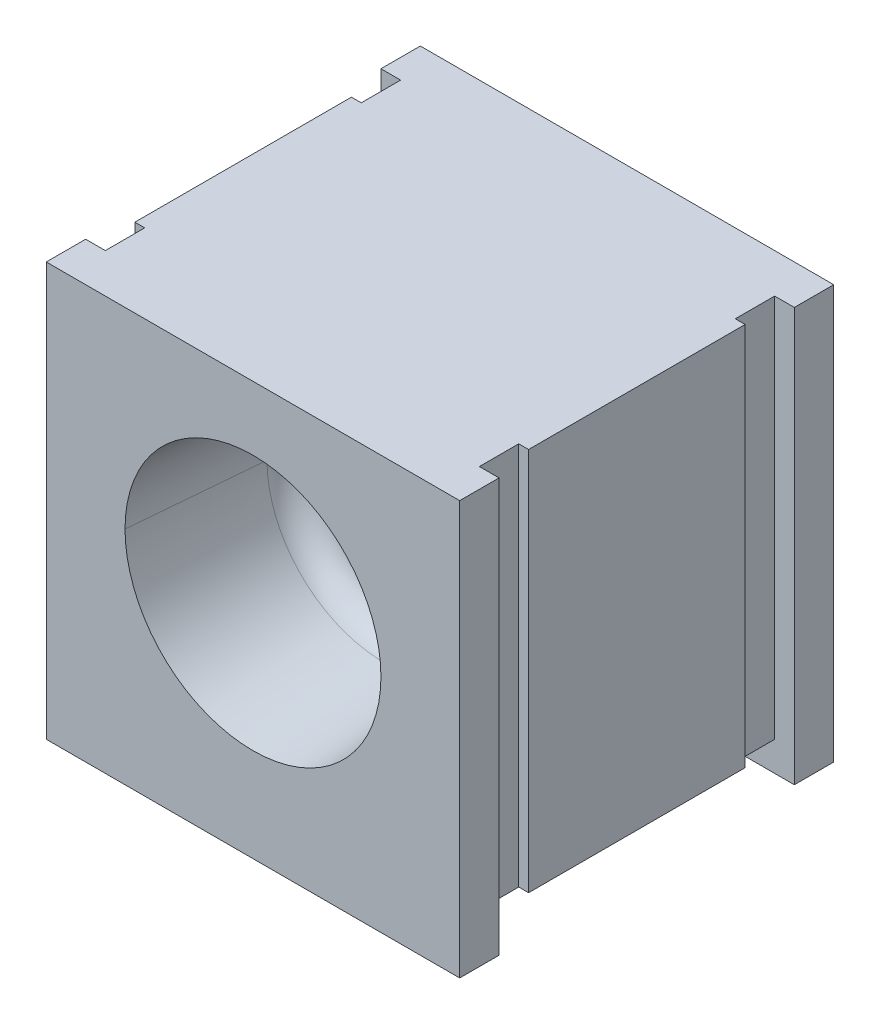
ISO-10303-21;
HEADER;
FILE_DESCRIPTION(('STEP AP214'),'2;1');
FILE_NAME('part.step','',(''),(''),'','','');
FILE_SCHEMA(('AUTOMOTIVE_DESIGN { 1 0 10303 214 1 1 1 1 }'));
ENDSEC;
DATA;
#1=APPLICATION_CONTEXT('core data for automotive mechanical design processes');
#2=APPLICATION_PROTOCOL_DEFINITION('international standard','automotive_design',2000,#1);
#3=PRODUCT_CONTEXT('',#1,'mechanical');
#4=PRODUCT('Part','Part','',(#3));
#5=PRODUCT_RELATED_PRODUCT_CATEGORY('part','',(#4));
#6=PRODUCT_DEFINITION_FORMATION('','',#4);
#7=PRODUCT_DEFINITION_CONTEXT('part definition',#1,'design');
#8=PRODUCT_DEFINITION('design','',#6,#7);
#9=PRODUCT_DEFINITION_SHAPE('','',#8);
#10=(LENGTH_UNIT() NAMED_UNIT(*) SI_UNIT(.MILLI.,.METRE.));
#11=(NAMED_UNIT(*) PLANE_ANGLE_UNIT() SI_UNIT($,.RADIAN.));
#12=(NAMED_UNIT(*) SI_UNIT($,.STERADIAN.) SOLID_ANGLE_UNIT());
#13=UNCERTAINTY_MEASURE_WITH_UNIT(LENGTH_MEASURE(1.E-05),#10,'distance_accuracy_value','');
#14=(GEOMETRIC_REPRESENTATION_CONTEXT(3) GLOBAL_UNCERTAINTY_ASSIGNED_CONTEXT((#13)) GLOBAL_UNIT_ASSIGNED_CONTEXT((#10,
#11,#12)) REPRESENTATION_CONTEXT('',''));
#15=CARTESIAN_POINT('',(0.,0.,0.));
#16=DIRECTION('',(0.,0.,1.));
#17=DIRECTION('',(1.,0.,0.));
#18=AXIS2_PLACEMENT_3D('',#15,#16,#17);
#19=CARTESIAN_POINT('',(0.,0.75,12.5));
#20=DIRECTION('',(0.,0.,1.));
#21=DIRECTION('',(1.,0.,0.));
#22=AXIS2_PLACEMENT_3D('',#19,#20,#21);
#23=TOROIDAL_SURFACE('',#22,4.42559393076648,1.5);
#24=CARTESIAN_POINT('',(-4.42559393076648,0.75,12.5));
#25=DIRECTION('',(0.,1.,0.));
#26=DIRECTION('',(-1.,0.,0.));
#27=AXIS2_PLACEMENT_3D('',#24,#25,#26);
#28=CIRCLE('',#27,1.5);
#29=CARTESIAN_POINT('',(-4.42559393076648,0.75,11.));
#30=VERTEX_POINT('',#29);
#31=CARTESIAN_POINT('',(-5.91988597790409,0.75,12.3692663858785));
#32=VERTEX_POINT('',#31);
#33=EDGE_CURVE('E354',#30,#32,#28,.T.);
#34=ORIENTED_EDGE('',*,*,#33,.F.);
#35=CARTESIAN_POINT('',(0.,0.75,11.));
#36=DIRECTION('',(0.,0.,1.));
#37=DIRECTION('',(1.,0.,0.));
#38=AXIS2_PLACEMENT_3D('',#35,#36,#37);
#39=CIRCLE('',#38,4.42559393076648);
#40=CARTESIAN_POINT('',(4.42559393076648,0.75,11.));
#41=VERTEX_POINT('',#40);
#42=EDGE_CURVE('E9',#41,#30,#39,.T.);
#43=ORIENTED_EDGE('',*,*,#42,.F.);
#44=CARTESIAN_POINT('',(4.42559393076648,0.75,12.5));
#45=DIRECTION('',(0.,-1.,0.));
#46=DIRECTION('',(0.,0.,-1.));
#47=AXIS2_PLACEMENT_3D('',#44,#45,#46);
#48=CIRCLE('',#47,1.5);
#49=CARTESIAN_POINT('',(5.91988597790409,0.75,12.3692663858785));
#50=VERTEX_POINT('',#49);
#51=EDGE_CURVE('E347',#41,#50,#48,.T.);
#52=ORIENTED_EDGE('',*,*,#51,.T.);
#53=CARTESIAN_POINT('',(0.,0.75,12.3692663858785));
#54=DIRECTION('',(0.,0.,-1.));
#55=DIRECTION('',(-1.,0.,0.));
#56=AXIS2_PLACEMENT_3D('',#53,#54,#55);
#57=CIRCLE('',#56,5.91988597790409);
#58=EDGE_CURVE('E23',#32,#50,#57,.T.);
#59=ORIENTED_EDGE('',*,*,#58,.F.);
#60=EDGE_LOOP('',(#34,#43,#52,#59));
#61=FACE_BOUND('',#60,.T.);
#62=ADVANCED_FACE('F15',(#61),#23,.F.);
#63=CARTESIAN_POINT('',(0.,0.75,11.));
#64=DIRECTION('',(0.,0.,1.));
#65=DIRECTION('',(1.,0.,0.));
#66=AXIS2_PLACEMENT_3D('',#63,#64,#65);
#67=PLANE('',#66);
#68=ORIENTED_EDGE('',*,*,#42,.T.);
#69=CARTESIAN_POINT('',(0.,0.75,11.));
#70=DIRECTION('',(0.,0.,1.));
#71=DIRECTION('',(1.,0.,0.));
#72=AXIS2_PLACEMENT_3D('',#69,#70,#71);
#73=CIRCLE('',#72,4.42559393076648);
#74=EDGE_CURVE('E361',#30,#41,#73,.T.);
#75=ORIENTED_EDGE('',*,*,#74,.T.);
#76=EDGE_LOOP('',(#68,#75));
#77=FACE_BOUND('',#76,.T.);
#78=ADVANCED_FACE('F556',(#77),#67,.T.);
#79=CARTESIAN_POINT('',(0.,0.75,19.));
#80=DIRECTION('',(0.,0.,1.));
#81=DIRECTION('',(1.,0.,0.));
#82=AXIS2_PLACEMENT_3D('',#79,#80,#81);
#83=CONICAL_SURFACE('',#82,6.5,0.0872664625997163);
#84=DIRECTION('',(-0.0871557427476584,0.,0.996194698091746));
#85=VECTOR('',#84,1.);
#86=CARTESIAN_POINT('',(-6.5,0.75,19.));
#87=LINE('',#86,#85);
#88=CARTESIAN_POINT('',(-6.5,0.75,19.));
#89=VERTEX_POINT('',#88);
#90=EDGE_CURVE('E331',#32,#89,#87,.T.);
#91=ORIENTED_EDGE('',*,*,#90,.F.);
#92=ORIENTED_EDGE('',*,*,#58,.T.);
#93=DIRECTION('',(0.0871557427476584,0.,0.996194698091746));
#94=VECTOR('',#93,1.);
#95=CARTESIAN_POINT('',(6.5,0.75,19.));
#96=LINE('',#95,#94);
#97=CARTESIAN_POINT('',(6.5,0.75,19.));
#98=VERTEX_POINT('',#97);
#99=EDGE_CURVE('E328',#50,#98,#96,.T.);
#100=ORIENTED_EDGE('',*,*,#99,.T.);
#101=CARTESIAN_POINT('',(0.,0.75,19.));
#102=DIRECTION('',(0.,0.,1.));
#103=DIRECTION('',(1.,0.,0.));
#104=AXIS2_PLACEMENT_3D('',#101,#102,#103);
#105=CIRCLE('',#104,6.5);
#106=EDGE_CURVE('E319',#98,#89,#105,.T.);
#107=ORIENTED_EDGE('',*,*,#106,.T.);
#108=EDGE_LOOP('',(#91,#92,#100,#107));
#109=FACE_BOUND('',#108,.T.);
#110=ADVANCED_FACE('F327',(#109),#83,.F.);
#111=CARTESIAN_POINT('',(-10.5,-10.5,19.));
#112=DIRECTION('',(0.,0.,1.));
#113=DIRECTION('',(1.,0.,0.));
#114=AXIS2_PLACEMENT_3D('',#111,#112,#113);
#115=PLANE('',#114);
#116=ORIENTED_EDGE('',*,*,#106,.F.);
#117=CARTESIAN_POINT('',(0.,0.75,19.));
#118=DIRECTION('',(0.,0.,1.));
#119=DIRECTION('',(1.,0.,0.));
#120=AXIS2_PLACEMENT_3D('',#117,#118,#119);
#121=CIRCLE('',#120,6.5);
#122=EDGE_CURVE('E342',#89,#98,#121,.T.);
#123=ORIENTED_EDGE('',*,*,#122,.F.);
#124=EDGE_LOOP('',(#116,#123));
#125=FACE_BOUND('',#124,.T.);
#126=DIRECTION('',(0.,-1.,0.));
#127=VECTOR('',#126,1.);
#128=CARTESIAN_POINT('',(-10.5,10.5,19.));
#129=LINE('',#128,#127);
#130=CARTESIAN_POINT('',(-10.5,10.5,19.));
#131=VERTEX_POINT('',#130);
#132=CARTESIAN_POINT('',(-10.5,-10.5,19.));
#133=VERTEX_POINT('',#132);
#134=EDGE_CURVE('E311',#131,#133,#129,.T.);
#135=ORIENTED_EDGE('',*,*,#134,.T.);
#136=DIRECTION('',(1.,0.,0.));
#137=VECTOR('',#136,1.);
#138=CARTESIAN_POINT('',(-10.5,-10.5,19.));
#139=LINE('',#138,#137);
#140=CARTESIAN_POINT('',(10.5,-10.5,19.));
#141=VERTEX_POINT('',#140);
#142=EDGE_CURVE('E43',#133,#141,#139,.T.);
#143=ORIENTED_EDGE('',*,*,#142,.T.);
#144=DIRECTION('',(0.,1.,0.));
#145=VECTOR('',#144,1.);
#146=CARTESIAN_POINT('',(10.5,10.5,19.));
#147=LINE('',#146,#145);
#148=CARTESIAN_POINT('',(10.5,10.5,19.));
#149=VERTEX_POINT('',#148);
#150=EDGE_CURVE('E34',#141,#149,#147,.T.);
#151=ORIENTED_EDGE('',*,*,#150,.T.);
#152=DIRECTION('',(-1.,0.,0.));
#153=VECTOR('',#152,1.);
#154=CARTESIAN_POINT('',(-10.5,10.5,19.));
#155=LINE('',#154,#153);
#156=EDGE_CURVE('E368',#149,#131,#155,.T.);
#157=ORIENTED_EDGE('',*,*,#156,.T.);
#158=EDGE_LOOP('',(#135,#143,#151,#157));
#159=FACE_BOUND('',#158,.T.);
#160=ADVANCED_FACE('F563',(#125,#159),#115,.T.);
#161=CARTESIAN_POINT('',(10.5,10.5,19.));
#162=DIRECTION('',(-1.,0.,0.));
#163=DIRECTION('',(0.,1.,0.));
#164=AXIS2_PLACEMENT_3D('',#161,#162,#163);
#165=PLANE('',#164);
#166=DIRECTION('',(0.,1.,0.));
#167=VECTOR('',#166,1.);
#168=CARTESIAN_POINT('',(10.5,10.5,17.));
#169=LINE('',#168,#167);
#170=CARTESIAN_POINT('',(10.5,-10.5,17.));
#171=VERTEX_POINT('',#170);
#172=CARTESIAN_POINT('',(10.5,10.5,17.));
#173=VERTEX_POINT('',#172);
#174=EDGE_CURVE('E296',#171,#173,#169,.T.);
#175=ORIENTED_EDGE('',*,*,#174,.T.);
#176=DIRECTION('',(0.,0.,-1.));
#177=VECTOR('',#176,1.);
#178=CARTESIAN_POINT('',(10.5,10.5,19.));
#179=LINE('',#178,#177);
#180=EDGE_CURVE('E483',#149,#173,#179,.T.);
#181=ORIENTED_EDGE('',*,*,#180,.F.);
#182=ORIENTED_EDGE('',*,*,#150,.F.);
#183=DIRECTION('',(0.,0.,-1.));
#184=VECTOR('',#183,1.);
#185=CARTESIAN_POINT('',(10.5,-10.5,19.));
#186=LINE('',#185,#184);
#187=EDGE_CURVE('E314',#141,#171,#186,.T.);
#188=ORIENTED_EDGE('',*,*,#187,.T.);
#189=EDGE_LOOP('',(#175,#181,#182,#188));
#190=FACE_BOUND('',#189,.T.);
#191=ADVANCED_FACE('F568',(#190),#165,.F.);
#192=CARTESIAN_POINT('',(-10.5,-10.5,19.));
#193=DIRECTION('',(0.,1.,0.));
#194=DIRECTION('',(1.,0.,0.));
#195=AXIS2_PLACEMENT_3D('',#192,#193,#194);
#196=PLANE('',#195);
#197=DIRECTION('',(1.,0.,0.));
#198=VECTOR('',#197,1.);
#199=CARTESIAN_POINT('',(-10.5,-10.5,17.));
#200=LINE('',#199,#198);
#201=CARTESIAN_POINT('',(-10.5,-10.5,17.));
#202=VERTEX_POINT('',#201);
#203=EDGE_CURVE('E299',#202,#171,#200,.T.);
#204=ORIENTED_EDGE('',*,*,#203,.T.);
#205=ORIENTED_EDGE('',*,*,#187,.F.);
#206=ORIENTED_EDGE('',*,*,#142,.F.);
#207=DIRECTION('',(0.,0.,-1.));
#208=VECTOR('',#207,1.);
#209=CARTESIAN_POINT('',(-10.5,-10.5,19.));
#210=LINE('',#209,#208);
#211=EDGE_CURVE('E308',#133,#202,#210,.T.);
#212=ORIENTED_EDGE('',*,*,#211,.T.);
#213=EDGE_LOOP('',(#204,#205,#206,#212));
#214=FACE_BOUND('',#213,.T.);
#215=ADVANCED_FACE('F572',(#214),#196,.F.);
#216=CARTESIAN_POINT('',(-10.5,10.5,19.));
#217=DIRECTION('',(1.,0.,0.));
#218=DIRECTION('',(0.,1.,0.));
#219=AXIS2_PLACEMENT_3D('',#216,#217,#218);
#220=PLANE('',#219);
#221=DIRECTION('',(0.,-1.,0.));
#222=VECTOR('',#221,1.);
#223=CARTESIAN_POINT('',(-10.5,10.5,17.));
#224=LINE('',#223,#222);
#225=CARTESIAN_POINT('',(-10.5,10.5,17.));
#226=VERTEX_POINT('',#225);
#227=EDGE_CURVE('E304',#226,#202,#224,.T.);
#228=ORIENTED_EDGE('',*,*,#227,.T.);
#229=ORIENTED_EDGE('',*,*,#211,.F.);
#230=ORIENTED_EDGE('',*,*,#134,.F.);
#231=DIRECTION('',(0.,0.,-1.));
#232=VECTOR('',#231,1.);
#233=CARTESIAN_POINT('',(-10.5,10.5,19.));
#234=LINE('',#233,#232);
#235=EDGE_CURVE('E366',#131,#226,#234,.T.);
#236=ORIENTED_EDGE('',*,*,#235,.T.);
#237=EDGE_LOOP('',(#228,#229,#230,#236));
#238=FACE_BOUND('',#237,.T.);
#239=ADVANCED_FACE('F575',(#238),#220,.F.);
#240=CARTESIAN_POINT('',(-10.5,-10.5,17.));
#241=DIRECTION('',(0.,0.,1.));
#242=DIRECTION('',(1.,0.,0.));
#243=AXIS2_PLACEMENT_3D('',#240,#241,#242);
#244=PLANE('',#243);
#245=DIRECTION('',(1.,0.,0.));
#246=VECTOR('',#245,1.);
#247=CARTESIAN_POINT('',(9.5,-9.,17.));
#248=LINE('',#247,#246);
#249=CARTESIAN_POINT('',(-9.5,-9.,17.));
#250=VERTEX_POINT('',#249);
#251=CARTESIAN_POINT('',(9.5,-9.,17.));
#252=VERTEX_POINT('',#251);
#253=EDGE_CURVE('E269',#250,#252,#248,.T.);
#254=ORIENTED_EDGE('',*,*,#253,.T.);
#255=DIRECTION('',(0.,1.,0.));
#256=VECTOR('',#255,1.);
#257=CARTESIAN_POINT('',(9.5,-9.,17.));
#258=LINE('',#257,#256);
#259=CARTESIAN_POINT('',(9.5,10.5,17.));
#260=VERTEX_POINT('',#259);
#261=EDGE_CURVE('E295',#252,#260,#258,.T.);
#262=ORIENTED_EDGE('',*,*,#261,.T.);
#263=DIRECTION('',(-1.,0.,0.));
#264=VECTOR('',#263,1.);
#265=CARTESIAN_POINT('',(-10.5,10.5,17.));
#266=LINE('',#265,#264);
#267=EDGE_CURVE('E253',#173,#260,#266,.T.);
#268=ORIENTED_EDGE('',*,*,#267,.F.);
#269=ORIENTED_EDGE('',*,*,#174,.F.);
#270=ORIENTED_EDGE('',*,*,#203,.F.);
#271=ORIENTED_EDGE('',*,*,#227,.F.);
#272=DIRECTION('',(-1.,0.,0.));
#273=VECTOR('',#272,1.);
#274=CARTESIAN_POINT('',(-10.5,10.5,17.));
#275=LINE('',#274,#273);
#276=CARTESIAN_POINT('',(-9.5,10.5,17.));
#277=VERTEX_POINT('',#276);
#278=EDGE_CURVE('E365',#277,#226,#275,.T.);
#279=ORIENTED_EDGE('',*,*,#278,.F.);
#280=DIRECTION('',(0.,-1.,0.));
#281=VECTOR('',#280,1.);
#282=CARTESIAN_POINT('',(-9.5,-9.,17.));
#283=LINE('',#282,#281);
#284=EDGE_CURVE('E300',#277,#250,#283,.T.);
#285=ORIENTED_EDGE('',*,*,#284,.T.);
#286=EDGE_LOOP('',(#254,#262,#268,#269,#270,#271,#279,#285));
#287=FACE_BOUND('',#286,.T.);
#288=ADVANCED_FACE('F494',(#287),#244,.F.);
#289=CARTESIAN_POINT('',(-9.5,-9.,17.));
#290=DIRECTION('',(1.,0.,0.));
#291=DIRECTION('',(0.,1.,0.));
#292=AXIS2_PLACEMENT_3D('',#289,#290,#291);
#293=PLANE('',#292);
#294=DIRECTION('',(0.,-1.,0.));
#295=VECTOR('',#294,1.);
#296=CARTESIAN_POINT('',(-9.5,-9.,15.));
#297=LINE('',#296,#295);
#298=CARTESIAN_POINT('',(-9.5,10.5,15.));
#299=VERTEX_POINT('',#298);
#300=CARTESIAN_POINT('',(-9.5,-9.,15.));
#301=VERTEX_POINT('',#300);
#302=EDGE_CURVE('E292',#299,#301,#297,.T.);
#303=ORIENTED_EDGE('',*,*,#302,.T.);
#304=DIRECTION('',(0.,0.,-1.));
#305=VECTOR('',#304,1.);
#306=CARTESIAN_POINT('',(-9.5,-9.,17.));
#307=LINE('',#306,#305);
#308=EDGE_CURVE('E273',#250,#301,#307,.T.);
#309=ORIENTED_EDGE('',*,*,#308,.F.);
#310=ORIENTED_EDGE('',*,*,#284,.F.);
#311=DIRECTION('',(0.,0.,-1.));
#312=VECTOR('',#311,1.);
#313=CARTESIAN_POINT('',(-9.5,10.5,17.));
#314=LINE('',#313,#312);
#315=EDGE_CURVE('E479',#277,#299,#314,.T.);
#316=ORIENTED_EDGE('',*,*,#315,.T.);
#317=EDGE_LOOP('',(#303,#309,#310,#316));
#318=FACE_BOUND('',#317,.T.);
#319=ADVANCED_FACE('F547',(#318),#293,.F.);
#320=CARTESIAN_POINT('',(9.5,-9.,17.));
#321=DIRECTION('',(-1.,0.,0.));
#322=DIRECTION('',(0.,0.,1.));
#323=AXIS2_PLACEMENT_3D('',#320,#321,#322);
#324=PLANE('',#323);
#325=DIRECTION('',(0.,1.,0.));
#326=VECTOR('',#325,1.);
#327=CARTESIAN_POINT('',(9.5,-9.,15.));
#328=LINE('',#327,#326);
#329=CARTESIAN_POINT('',(9.5,-9.,15.));
#330=VERTEX_POINT('',#329);
#331=CARTESIAN_POINT('',(9.5,10.5,15.));
#332=VERTEX_POINT('',#331);
#333=EDGE_CURVE('E344',#330,#332,#328,.T.);
#334=ORIENTED_EDGE('',*,*,#333,.T.);
#335=DIRECTION('',(0.,0.,-1.));
#336=VECTOR('',#335,1.);
#337=CARTESIAN_POINT('',(9.5,10.5,17.));
#338=LINE('',#337,#336);
#339=EDGE_CURVE('E248',#260,#332,#338,.T.);
#340=ORIENTED_EDGE('',*,*,#339,.F.);
#341=ORIENTED_EDGE('',*,*,#261,.F.);
#342=DIRECTION('',(0.,0.,-1.));
#343=VECTOR('',#342,1.);
#344=CARTESIAN_POINT('',(9.5,-9.,17.));
#345=LINE('',#344,#343);
#346=EDGE_CURVE('E274',#252,#330,#345,.T.);
#347=ORIENTED_EDGE('',*,*,#346,.T.);
#348=EDGE_LOOP('',(#334,#340,#341,#347));
#349=FACE_BOUND('',#348,.T.);
#350=ADVANCED_FACE('F499',(#349),#324,.F.);
#351=CARTESIAN_POINT('',(-10.,-9.,15.));
#352=DIRECTION('',(0.,0.,1.));
#353=DIRECTION('',(1.,0.,0.));
#354=AXIS2_PLACEMENT_3D('',#351,#352,#353);
#355=PLANE('',#354);
#356=ORIENTED_EDGE('',*,*,#302,.F.);
#357=DIRECTION('',(-1.,0.,0.));
#358=VECTOR('',#357,1.);
#359=CARTESIAN_POINT('',(-10.,10.5,15.));
#360=LINE('',#359,#358);
#361=CARTESIAN_POINT('',(-10.,10.5,15.));
#362=VERTEX_POINT('',#361);
#363=EDGE_CURVE('E475',#299,#362,#360,.T.);
#364=ORIENTED_EDGE('',*,*,#363,.T.);
#365=DIRECTION('',(0.,-1.,0.));
#366=VECTOR('',#365,1.);
#367=CARTESIAN_POINT('',(-10.,10.5,15.));
#368=LINE('',#367,#366);
#369=CARTESIAN_POINT('',(-10.,-9.,15.));
#370=VERTEX_POINT('',#369);
#371=EDGE_CURVE('E231',#362,#370,#368,.T.);
#372=ORIENTED_EDGE('',*,*,#371,.T.);
#373=DIRECTION('',(1.,0.,0.));
#374=VECTOR('',#373,1.);
#375=CARTESIAN_POINT('',(-10.,-9.,15.));
#376=LINE('',#375,#374);
#377=EDGE_CURVE('E275',#370,#301,#376,.T.);
#378=ORIENTED_EDGE('',*,*,#377,.T.);
#379=EDGE_LOOP('',(#356,#364,#372,#378));
#380=FACE_BOUND('',#379,.T.);
#381=ADVANCED_FACE('F543',(#380),#355,.T.);
#382=CARTESIAN_POINT('',(10.,10.5,6.));
#383=DIRECTION('',(-1.,0.,0.));
#384=DIRECTION('',(0.,1.,0.));
#385=AXIS2_PLACEMENT_3D('',#382,#383,#384);
#386=PLANE('',#385);
#387=DIRECTION('',(0.,1.,0.));
#388=VECTOR('',#387,1.);
#389=CARTESIAN_POINT('',(10.,10.5,4.));
#390=LINE('',#389,#388);
#391=CARTESIAN_POINT('',(10.,-9.,4.));
#392=VERTEX_POINT('',#391);
#393=CARTESIAN_POINT('',(10.,10.5,4.));
#394=VERTEX_POINT('',#393);
#395=EDGE_CURVE('E219',#392,#394,#390,.T.);
#396=ORIENTED_EDGE('',*,*,#395,.T.);
#397=DIRECTION('',(0.,0.,-1.));
#398=VECTOR('',#397,1.);
#399=CARTESIAN_POINT('',(10.,10.5,6.));
#400=LINE('',#399,#398);
#401=CARTESIAN_POINT('',(10.,10.5,15.));
#402=VERTEX_POINT('',#401);
#403=EDGE_CURVE('E224',#402,#394,#400,.T.);
#404=ORIENTED_EDGE('',*,*,#403,.F.);
#405=DIRECTION('',(0.,1.,0.));
#406=VECTOR('',#405,1.);
#407=CARTESIAN_POINT('',(10.,10.5,15.));
#408=LINE('',#407,#406);
#409=CARTESIAN_POINT('',(10.,-9.,15.));
#410=VERTEX_POINT('',#409);
#411=EDGE_CURVE('E400',#410,#402,#408,.T.);
#412=ORIENTED_EDGE('',*,*,#411,.F.);
#413=DIRECTION('',(0.,0.,-1.));
#414=VECTOR('',#413,1.);
#415=CARTESIAN_POINT('',(10.,-9.,6.));
#416=LINE('',#415,#414);
#417=EDGE_CURVE('E226',#410,#392,#416,.T.);
#418=ORIENTED_EDGE('',*,*,#417,.T.);
#419=EDGE_LOOP('',(#396,#404,#412,#418));
#420=FACE_BOUND('',#419,.T.);
#421=ADVANCED_FACE('F221',(#420),#386,.F.);
#422=CARTESIAN_POINT('',(-10.,10.5,6.));
#423=DIRECTION('',(1.,0.,0.));
#424=DIRECTION('',(0.,1.,0.));
#425=AXIS2_PLACEMENT_3D('',#422,#423,#424);
#426=PLANE('',#425);
#427=DIRECTION('',(0.,-1.,0.));
#428=VECTOR('',#427,1.);
#429=CARTESIAN_POINT('',(-10.,10.5,4.));
#430=LINE('',#429,#428);
#431=CARTESIAN_POINT('',(-10.,10.5,4.));
#432=VERTEX_POINT('',#431);
#433=CARTESIAN_POINT('',(-10.,-9.,4.));
#434=VERTEX_POINT('',#433);
#435=EDGE_CURVE('E232',#432,#434,#430,.T.);
#436=ORIENTED_EDGE('',*,*,#435,.T.);
#437=DIRECTION('',(0.,0.,-1.));
#438=VECTOR('',#437,1.);
#439=CARTESIAN_POINT('',(-10.,-9.,6.));
#440=LINE('',#439,#438);
#441=EDGE_CURVE('E279',#370,#434,#440,.T.);
#442=ORIENTED_EDGE('',*,*,#441,.F.);
#443=ORIENTED_EDGE('',*,*,#371,.F.);
#444=DIRECTION('',(0.,0.,-1.));
#445=VECTOR('',#444,1.);
#446=CARTESIAN_POINT('',(-10.,10.5,6.));
#447=LINE('',#446,#445);
#448=EDGE_CURVE('E471',#362,#432,#447,.T.);
#449=ORIENTED_EDGE('',*,*,#448,.T.);
#450=EDGE_LOOP('',(#436,#442,#443,#449));
#451=FACE_BOUND('',#450,.T.);
#452=ADVANCED_FACE('F537',(#451),#426,.F.);
#453=CARTESIAN_POINT('',(-10.,-9.,4.));
#454=DIRECTION('',(0.,0.,1.));
#455=DIRECTION('',(1.,0.,0.));
#456=AXIS2_PLACEMENT_3D('',#453,#454,#455);
#457=PLANE('',#456);
#458=DIRECTION('',(1.,0.,0.));
#459=VECTOR('',#458,1.);
#460=CARTESIAN_POINT('',(-10.,-9.,4.));
#461=LINE('',#460,#459);
#462=CARTESIAN_POINT('',(9.5,-9.,4.));
#463=VERTEX_POINT('',#462);
#464=EDGE_CURVE('E266',#463,#392,#461,.T.);
#465=ORIENTED_EDGE('',*,*,#464,.F.);
#466=DIRECTION('',(0.,1.,0.));
#467=VECTOR('',#466,1.);
#468=CARTESIAN_POINT('',(9.5,10.5,4.));
#469=LINE('',#468,#467);
#470=CARTESIAN_POINT('',(9.5,10.5,4.));
#471=VERTEX_POINT('',#470);
#472=EDGE_CURVE('E237',#463,#471,#469,.T.);
#473=ORIENTED_EDGE('',*,*,#472,.T.);
#474=DIRECTION('',(-1.,0.,0.));
#475=VECTOR('',#474,1.);
#476=CARTESIAN_POINT('',(-10.,10.5,4.));
#477=LINE('',#476,#475);
#478=EDGE_CURVE('E235',#394,#471,#477,.T.);
#479=ORIENTED_EDGE('',*,*,#478,.F.);
#480=ORIENTED_EDGE('',*,*,#395,.F.);
#481=EDGE_LOOP('',(#465,#473,#479,#480));
#482=FACE_BOUND('',#481,.T.);
#483=ADVANCED_FACE('F236',(#482),#457,.F.);
#484=CARTESIAN_POINT('',(-10.,-9.,4.));
#485=DIRECTION('',(0.,0.,1.));
#486=DIRECTION('',(1.,0.,0.));
#487=AXIS2_PLACEMENT_3D('',#484,#485,#486);
#488=PLANE('',#487);
#489=DIRECTION('',(-1.,0.,0.));
#490=VECTOR('',#489,1.);
#491=CARTESIAN_POINT('',(-10.,10.5,4.));
#492=LINE('',#491,#490);
#493=CARTESIAN_POINT('',(-9.5,10.5,4.));
#494=VERTEX_POINT('',#493);
#495=EDGE_CURVE('E465',#494,#432,#492,.T.);
#496=ORIENTED_EDGE('',*,*,#495,.F.);
#497=DIRECTION('',(0.,-1.,0.));
#498=VECTOR('',#497,1.);
#499=CARTESIAN_POINT('',(-9.5,10.5,4.));
#500=LINE('',#499,#498);
#501=CARTESIAN_POINT('',(-9.5,-9.,4.));
#502=VERTEX_POINT('',#501);
#503=EDGE_CURVE('E259',#494,#502,#500,.T.);
#504=ORIENTED_EDGE('',*,*,#503,.T.);
#505=DIRECTION('',(1.,0.,0.));
#506=VECTOR('',#505,1.);
#507=CARTESIAN_POINT('',(-10.,-9.,4.));
#508=LINE('',#507,#506);
#509=EDGE_CURVE('E283',#434,#502,#508,.T.);
#510=ORIENTED_EDGE('',*,*,#509,.F.);
#511=ORIENTED_EDGE('',*,*,#435,.F.);
#512=EDGE_LOOP('',(#496,#504,#510,#511));
#513=FACE_BOUND('',#512,.T.);
#514=ADVANCED_FACE('F534',(#513),#488,.F.);
#515=CARTESIAN_POINT('',(9.5,10.5,4.));
#516=DIRECTION('',(-1.,0.,0.));
#517=DIRECTION('',(0.,1.,0.));
#518=AXIS2_PLACEMENT_3D('',#515,#516,#517);
#519=PLANE('',#518);
#520=DIRECTION('',(0.,1.,0.));
#521=VECTOR('',#520,1.);
#522=CARTESIAN_POINT('',(9.5,10.5,2.));
#523=LINE('',#522,#521);
#524=CARTESIAN_POINT('',(9.5,-9.,2.));
#525=VERTEX_POINT('',#524);
#526=CARTESIAN_POINT('',(9.5,10.5,2.));
#527=VERTEX_POINT('',#526);
#528=EDGE_CURVE('E418',#525,#527,#523,.T.);
#529=ORIENTED_EDGE('',*,*,#528,.T.);
#530=DIRECTION('',(0.,0.,-1.));
#531=VECTOR('',#530,1.);
#532=CARTESIAN_POINT('',(9.5,10.5,4.));
#533=LINE('',#532,#531);
#534=EDGE_CURVE('E241',#471,#527,#533,.T.);
#535=ORIENTED_EDGE('',*,*,#534,.F.);
#536=ORIENTED_EDGE('',*,*,#472,.F.);
#537=DIRECTION('',(0.,0.,-1.));
#538=VECTOR('',#537,1.);
#539=CARTESIAN_POINT('',(9.5,-9.,4.));
#540=LINE('',#539,#538);
#541=EDGE_CURVE('E263',#463,#525,#540,.T.);
#542=ORIENTED_EDGE('',*,*,#541,.T.);
#543=EDGE_LOOP('',(#529,#535,#536,#542));
#544=FACE_BOUND('',#543,.T.);
#545=ADVANCED_FACE('F510',(#544),#519,.F.);
#546=CARTESIAN_POINT('',(-9.5,-9.,4.));
#547=DIRECTION('',(0.,1.,0.));
#548=DIRECTION('',(1.,0.,0.));
#549=AXIS2_PLACEMENT_3D('',#546,#547,#548);
#550=PLANE('',#549);
#551=DIRECTION('',(1.,0.,0.));
#552=VECTOR('',#551,1.);
#553=CARTESIAN_POINT('',(-9.5,-9.,2.));
#554=LINE('',#553,#552);
#555=CARTESIAN_POINT('',(-9.5,-9.,2.));
#556=VERTEX_POINT('',#555);
#557=EDGE_CURVE('E425',#556,#525,#554,.T.);
#558=ORIENTED_EDGE('',*,*,#557,.T.);
#559=ORIENTED_EDGE('',*,*,#541,.F.);
#560=ORIENTED_EDGE('',*,*,#464,.T.);
#561=ORIENTED_EDGE('',*,*,#417,.F.);
#562=DIRECTION('',(1.,0.,0.));
#563=VECTOR('',#562,1.);
#564=CARTESIAN_POINT('',(-10.,-9.,15.));
#565=LINE('',#564,#563);
#566=EDGE_CURVE('E395',#330,#410,#565,.T.);
#567=ORIENTED_EDGE('',*,*,#566,.F.);
#568=ORIENTED_EDGE('',*,*,#346,.F.);
#569=ORIENTED_EDGE('',*,*,#253,.F.);
#570=ORIENTED_EDGE('',*,*,#308,.T.);
#571=ORIENTED_EDGE('',*,*,#377,.F.);
#572=ORIENTED_EDGE('',*,*,#441,.T.);
#573=ORIENTED_EDGE('',*,*,#509,.T.);
#574=DIRECTION('',(0.,0.,-1.));
#575=VECTOR('',#574,1.);
#576=CARTESIAN_POINT('',(-9.5,-9.,4.));
#577=LINE('',#576,#575);
#578=EDGE_CURVE('E257',#502,#556,#577,.T.);
#579=ORIENTED_EDGE('',*,*,#578,.T.);
#580=EDGE_LOOP('',(#558,#559,#560,#561,#567,#568,#569,#570,#571,#572,#573,#579));
#581=FACE_BOUND('',#580,.T.);
#582=ADVANCED_FACE('F505',(#581),#550,.F.);
#583=CARTESIAN_POINT('',(-9.5,10.5,4.));
#584=DIRECTION('',(1.,0.,0.));
#585=DIRECTION('',(0.,1.,0.));
#586=AXIS2_PLACEMENT_3D('',#583,#584,#585);
#587=PLANE('',#586);
#588=DIRECTION('',(0.,-1.,0.));
#589=VECTOR('',#588,1.);
#590=CARTESIAN_POINT('',(-9.5,10.5,2.));
#591=LINE('',#590,#589);
#592=CARTESIAN_POINT('',(-9.5,10.5,2.));
#593=VERTEX_POINT('',#592);
#594=EDGE_CURVE('E385',#593,#556,#591,.T.);
#595=ORIENTED_EDGE('',*,*,#594,.T.);
#596=ORIENTED_EDGE('',*,*,#578,.F.);
#597=ORIENTED_EDGE('',*,*,#503,.F.);
#598=DIRECTION('',(0.,0.,-1.));
#599=VECTOR('',#598,1.);
#600=CARTESIAN_POINT('',(-9.5,10.5,4.));
#601=LINE('',#600,#599);
#602=EDGE_CURVE('E460',#494,#593,#601,.T.);
#603=ORIENTED_EDGE('',*,*,#602,.T.);
#604=EDGE_LOOP('',(#595,#596,#597,#603));
#605=FACE_BOUND('',#604,.T.);
#606=ADVANCED_FACE('F530',(#605),#587,.F.);
#607=CARTESIAN_POINT('',(-10.5,10.5,0.));
#608=DIRECTION('',(0.,0.,-1.));
#609=DIRECTION('',(0.,-1.,0.));
#610=AXIS2_PLACEMENT_3D('',#607,#608,#609);
#611=PLANE('',#610);
#612=DIRECTION('',(0.,-1.,0.));
#613=VECTOR('',#612,1.);
#614=CARTESIAN_POINT('',(-10.5,-10.5,0.));
#615=LINE('',#614,#613);
#616=CARTESIAN_POINT('',(-10.5,10.5,0.));
#617=VERTEX_POINT('',#616);
#618=CARTESIAN_POINT('',(-10.5,-10.5,0.));
#619=VERTEX_POINT('',#618);
#620=EDGE_CURVE('E429',#617,#619,#615,.T.);
#621=ORIENTED_EDGE('',*,*,#620,.F.);
#622=DIRECTION('',(-1.,0.,0.));
#623=VECTOR('',#622,1.);
#624=CARTESIAN_POINT('',(-10.5,10.5,0.));
#625=LINE('',#624,#623);
#626=CARTESIAN_POINT('',(10.5,10.5,0.));
#627=VERTEX_POINT('',#626);
#628=EDGE_CURVE('E457',#627,#617,#625,.T.);
#629=ORIENTED_EDGE('',*,*,#628,.F.);
#630=DIRECTION('',(0.,1.,0.));
#631=VECTOR('',#630,1.);
#632=CARTESIAN_POINT('',(10.5,-10.5,0.));
#633=LINE('',#632,#631);
#634=CARTESIAN_POINT('',(10.5,-10.5,0.));
#635=VERTEX_POINT('',#634);
#636=EDGE_CURVE('E449',#635,#627,#633,.T.);
#637=ORIENTED_EDGE('',*,*,#636,.F.);
#638=DIRECTION('',(1.,0.,0.));
#639=VECTOR('',#638,1.);
#640=CARTESIAN_POINT('',(-10.5,-10.5,0.));
#641=LINE('',#640,#639);
#642=EDGE_CURVE('E441',#619,#635,#641,.T.);
#643=ORIENTED_EDGE('',*,*,#642,.F.);
#644=EDGE_LOOP('',(#621,#629,#637,#643));
#645=FACE_BOUND('',#644,.T.);
#646=ADVANCED_FACE('F521',(#645),#611,.T.);
#647=CARTESIAN_POINT('',(-10.5,10.5,2.));
#648=DIRECTION('',(0.,-1.,0.));
#649=DIRECTION('',(0.,0.,-1.));
#650=AXIS2_PLACEMENT_3D('',#647,#648,#649);
#651=PLANE('',#650);
#652=ORIENTED_EDGE('',*,*,#628,.T.);
#653=DIRECTION('',(0.,0.,-1.));
#654=VECTOR('',#653,1.);
#655=CARTESIAN_POINT('',(-10.5,10.5,2.));
#656=LINE('',#655,#654);
#657=CARTESIAN_POINT('',(-10.5,10.5,2.));
#658=VERTEX_POINT('',#657);
#659=EDGE_CURVE('E437',#658,#617,#656,.T.);
#660=ORIENTED_EDGE('',*,*,#659,.F.);
#661=DIRECTION('',(-1.,0.,0.));
#662=VECTOR('',#661,1.);
#663=CARTESIAN_POINT('',(-10.5,10.5,2.));
#664=LINE('',#663,#662);
#665=EDGE_CURVE('E380',#593,#658,#664,.T.);
#666=ORIENTED_EDGE('',*,*,#665,.F.);
#667=ORIENTED_EDGE('',*,*,#602,.F.);
#668=ORIENTED_EDGE('',*,*,#495,.T.);
#669=ORIENTED_EDGE('',*,*,#448,.F.);
#670=ORIENTED_EDGE('',*,*,#363,.F.);
#671=ORIENTED_EDGE('',*,*,#315,.F.);
#672=ORIENTED_EDGE('',*,*,#278,.T.);
#673=ORIENTED_EDGE('',*,*,#235,.F.);
#674=ORIENTED_EDGE('',*,*,#156,.F.);
#675=ORIENTED_EDGE('',*,*,#180,.T.);
#676=ORIENTED_EDGE('',*,*,#267,.T.);
#677=ORIENTED_EDGE('',*,*,#339,.T.);
#678=DIRECTION('',(-1.,0.,0.));
#679=VECTOR('',#678,1.);
#680=CARTESIAN_POINT('',(-10.,10.5,15.));
#681=LINE('',#680,#679);
#682=EDGE_CURVE('E245',#402,#332,#681,.T.);
#683=ORIENTED_EDGE('',*,*,#682,.F.);
#684=ORIENTED_EDGE('',*,*,#403,.T.);
#685=ORIENTED_EDGE('',*,*,#478,.T.);
#686=ORIENTED_EDGE('',*,*,#534,.T.);
#687=DIRECTION('',(-1.,0.,0.));
#688=VECTOR('',#687,1.);
#689=CARTESIAN_POINT('',(-10.5,10.5,2.));
#690=LINE('',#689,#688);
#691=CARTESIAN_POINT('',(10.5,10.5,2.));
#692=VERTEX_POINT('',#691);
#693=EDGE_CURVE('E376',#692,#527,#690,.T.);
#694=ORIENTED_EDGE('',*,*,#693,.F.);
#695=DIRECTION('',(0.,0.,-1.));
#696=VECTOR('',#695,1.);
#697=CARTESIAN_POINT('',(10.5,10.5,2.));
#698=LINE('',#697,#696);
#699=EDGE_CURVE('E453',#692,#627,#698,.T.);
#700=ORIENTED_EDGE('',*,*,#699,.T.);
#701=EDGE_LOOP('',(#652,#660,#666,#667,#668,#669,#670,#671,#672,#673,#674,#675,#676,#677,#683,
#684,#685,#686,#694,#700));
#702=FACE_BOUND('',#701,.T.);
#703=ADVANCED_FACE('F243',(#702),#651,.F.);
#704=CARTESIAN_POINT('',(10.5,-10.5,2.));
#705=DIRECTION('',(-1.,0.,0.));
#706=DIRECTION('',(0.,0.,1.));
#707=AXIS2_PLACEMENT_3D('',#704,#705,#706);
#708=PLANE('',#707);
#709=ORIENTED_EDGE('',*,*,#636,.T.);
#710=ORIENTED_EDGE('',*,*,#699,.F.);
#711=DIRECTION('',(0.,1.,0.));
#712=VECTOR('',#711,1.);
#713=CARTESIAN_POINT('',(10.5,-10.5,2.));
#714=LINE('',#713,#712);
#715=CARTESIAN_POINT('',(10.5,-10.5,2.));
#716=VERTEX_POINT('',#715);
#717=EDGE_CURVE('E372',#716,#692,#714,.T.);
#718=ORIENTED_EDGE('',*,*,#717,.F.);
#719=DIRECTION('',(0.,0.,-1.));
#720=VECTOR('',#719,1.);
#721=CARTESIAN_POINT('',(10.5,-10.5,2.));
#722=LINE('',#721,#720);
#723=EDGE_CURVE('E445',#716,#635,#722,.T.);
#724=ORIENTED_EDGE('',*,*,#723,.T.);
#725=EDGE_LOOP('',(#709,#710,#718,#724));
#726=FACE_BOUND('',#725,.T.);
#727=ADVANCED_FACE('F518',(#726),#708,.F.);
#728=CARTESIAN_POINT('',(-10.5,-10.5,2.));
#729=DIRECTION('',(0.,1.,0.));
#730=DIRECTION('',(1.,0.,0.));
#731=AXIS2_PLACEMENT_3D('',#728,#729,#730);
#732=PLANE('',#731);
#733=ORIENTED_EDGE('',*,*,#642,.T.);
#734=ORIENTED_EDGE('',*,*,#723,.F.);
#735=DIRECTION('',(1.,0.,0.));
#736=VECTOR('',#735,1.);
#737=CARTESIAN_POINT('',(-10.5,-10.5,2.));
#738=LINE('',#737,#736);
#739=CARTESIAN_POINT('',(-10.5,-10.5,2.));
#740=VERTEX_POINT('',#739);
#741=EDGE_CURVE('E377',#740,#716,#738,.T.);
#742=ORIENTED_EDGE('',*,*,#741,.F.);
#743=DIRECTION('',(0.,0.,-1.));
#744=VECTOR('',#743,1.);
#745=CARTESIAN_POINT('',(-10.5,-10.5,2.));
#746=LINE('',#745,#744);
#747=EDGE_CURVE('E433',#740,#619,#746,.T.);
#748=ORIENTED_EDGE('',*,*,#747,.T.);
#749=EDGE_LOOP('',(#733,#734,#742,#748));
#750=FACE_BOUND('',#749,.T.);
#751=ADVANCED_FACE('F597',(#750),#732,.F.);
#752=CARTESIAN_POINT('',(-10.5,-10.5,2.));
#753=DIRECTION('',(1.,0.,0.));
#754=DIRECTION('',(0.,1.,0.));
#755=AXIS2_PLACEMENT_3D('',#752,#753,#754);
#756=PLANE('',#755);
#757=ORIENTED_EDGE('',*,*,#620,.T.);
#758=ORIENTED_EDGE('',*,*,#747,.F.);
#759=DIRECTION('',(0.,-1.,0.));
#760=VECTOR('',#759,1.);
#761=CARTESIAN_POINT('',(-10.5,-10.5,2.));
#762=LINE('',#761,#760);
#763=EDGE_CURVE('E384',#658,#740,#762,.T.);
#764=ORIENTED_EDGE('',*,*,#763,.F.);
#765=ORIENTED_EDGE('',*,*,#659,.T.);
#766=EDGE_LOOP('',(#757,#758,#764,#765));
#767=FACE_BOUND('',#766,.T.);
#768=ADVANCED_FACE('F525',(#767),#756,.F.);
#769=CARTESIAN_POINT('',(-10.5,10.5,2.));
#770=DIRECTION('',(0.,0.,-1.));
#771=DIRECTION('',(0.,-1.,0.));
#772=AXIS2_PLACEMENT_3D('',#769,#770,#771);
#773=PLANE('',#772);
#774=ORIENTED_EDGE('',*,*,#594,.F.);
#775=ORIENTED_EDGE('',*,*,#665,.T.);
#776=ORIENTED_EDGE('',*,*,#763,.T.);
#777=ORIENTED_EDGE('',*,*,#741,.T.);
#778=ORIENTED_EDGE('',*,*,#717,.T.);
#779=ORIENTED_EDGE('',*,*,#693,.T.);
#780=ORIENTED_EDGE('',*,*,#528,.F.);
#781=ORIENTED_EDGE('',*,*,#557,.F.);
#782=EDGE_LOOP('',(#774,#775,#776,#777,#778,#779,#780,#781));
#783=FACE_BOUND('',#782,.T.);
#784=ADVANCED_FACE('F515',(#783),#773,.F.);
#785=CARTESIAN_POINT('',(-10.,-9.,15.));
#786=DIRECTION('',(0.,0.,1.));
#787=DIRECTION('',(1.,0.,0.));
#788=AXIS2_PLACEMENT_3D('',#785,#786,#787);
#789=PLANE('',#788);
#790=ORIENTED_EDGE('',*,*,#333,.F.);
#791=ORIENTED_EDGE('',*,*,#566,.T.);
#792=ORIENTED_EDGE('',*,*,#411,.T.);
#793=ORIENTED_EDGE('',*,*,#682,.T.);
#794=EDGE_LOOP('',(#790,#791,#792,#793));
#795=FACE_BOUND('',#794,.T.);
#796=ADVANCED_FACE('F503',(#795),#789,.T.);
#797=CARTESIAN_POINT('',(0.,0.75,19.));
#798=DIRECTION('',(0.,0.,1.));
#799=DIRECTION('',(1.,0.,0.));
#800=AXIS2_PLACEMENT_3D('',#797,#798,#799);
#801=CONICAL_SURFACE('',#800,6.5,0.0872664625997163);
#802=CARTESIAN_POINT('',(0.,0.75,12.3692663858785));
#803=DIRECTION('',(0.,0.,-1.));
#804=DIRECTION('',(-1.,0.,0.));
#805=AXIS2_PLACEMENT_3D('',#802,#803,#804);
#806=CIRCLE('',#805,5.91988597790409);
#807=EDGE_CURVE('E339',#50,#32,#806,.T.);
#808=ORIENTED_EDGE('',*,*,#807,.T.);
#809=ORIENTED_EDGE('',*,*,#90,.T.);
#810=ORIENTED_EDGE('',*,*,#122,.T.);
#811=ORIENTED_EDGE('',*,*,#99,.F.);
#812=EDGE_LOOP('',(#808,#809,#810,#811));
#813=FACE_BOUND('',#812,.T.);
#814=ADVANCED_FACE('F337',(#813),#801,.F.);
#815=CARTESIAN_POINT('',(0.,0.75,12.5));
#816=DIRECTION('',(0.,0.,1.));
#817=DIRECTION('',(1.,0.,0.));
#818=AXIS2_PLACEMENT_3D('',#815,#816,#817);
#819=TOROIDAL_SURFACE('',#818,4.42559393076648,1.5);
#820=ORIENTED_EDGE('',*,*,#74,.F.);
#821=ORIENTED_EDGE('',*,*,#33,.T.);
#822=ORIENTED_EDGE('',*,*,#807,.F.);
#823=ORIENTED_EDGE('',*,*,#51,.F.);
#824=EDGE_LOOP('',(#820,#821,#822,#823));
#825=FACE_BOUND('',#824,.T.);
#826=ADVANCED_FACE('F353',(#825),#819,.F.);
#827=CLOSED_SHELL('',(#62,#78,#110,#160,#191,#215,#239,#288,#319,#350,#381,#421,#452,#483,#514,
#545,#582,#606,#646,#703,#727,#751,#768,#784,#796,#814,#826));
#828=MANIFOLD_SOLID_BREP('B1',#827);
#829=ADVANCED_BREP_SHAPE_REPRESENTATION('',(#18,#828),#14);
#830=SHAPE_DEFINITION_REPRESENTATION(#9,#829);
ENDSEC;
END-ISO-10303-21;
